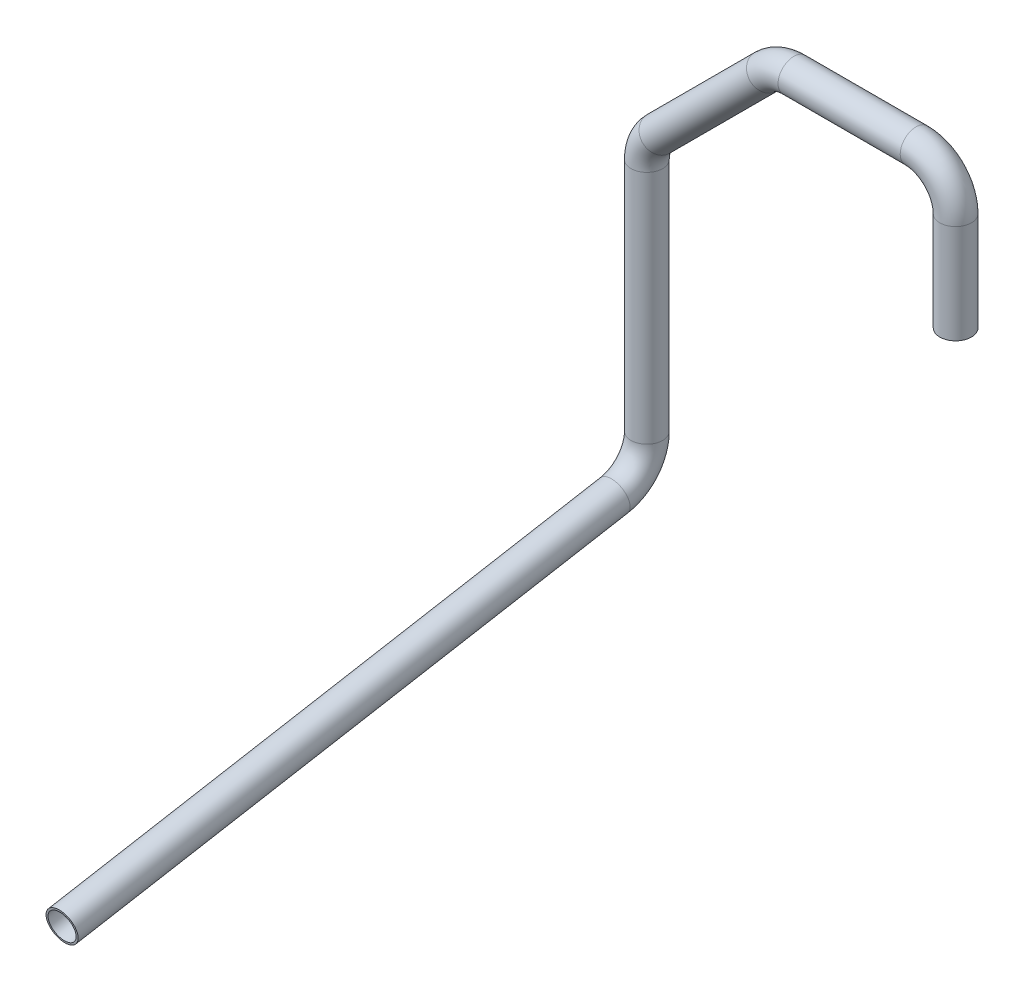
ISO-10303-21;
HEADER;
FILE_DESCRIPTION(('STEP AP214'),'2;1');
FILE_NAME('part.step','',(''),(''),'','','');
FILE_SCHEMA(('AUTOMOTIVE_DESIGN { 1 0 10303 214 1 1 1 1 }'));
ENDSEC;
DATA;
#1=APPLICATION_CONTEXT('core data for automotive mechanical design processes');
#2=APPLICATION_PROTOCOL_DEFINITION('international standard','automotive_design',2000,#1);
#3=PRODUCT_CONTEXT('',#1,'mechanical');
#4=PRODUCT('Part','Part','',(#3));
#5=PRODUCT_RELATED_PRODUCT_CATEGORY('part','',(#4));
#6=PRODUCT_DEFINITION_FORMATION('','',#4);
#7=PRODUCT_DEFINITION_CONTEXT('part definition',#1,'design');
#8=PRODUCT_DEFINITION('design','',#6,#7);
#9=PRODUCT_DEFINITION_SHAPE('','',#8);
#10=(LENGTH_UNIT() NAMED_UNIT(*) SI_UNIT(.MILLI.,.METRE.));
#11=(NAMED_UNIT(*) PLANE_ANGLE_UNIT() SI_UNIT($,.RADIAN.));
#12=(NAMED_UNIT(*) SI_UNIT($,.STERADIAN.) SOLID_ANGLE_UNIT());
#13=UNCERTAINTY_MEASURE_WITH_UNIT(LENGTH_MEASURE(1.E-05),#10,'distance_accuracy_value','');
#14=(GEOMETRIC_REPRESENTATION_CONTEXT(3) GLOBAL_UNCERTAINTY_ASSIGNED_CONTEXT((#13)) GLOBAL_UNIT_ASSIGNED_CONTEXT((#10,
#11,#12)) REPRESENTATION_CONTEXT('',''));
#15=CARTESIAN_POINT('',(0.,0.,0.));
#16=DIRECTION('',(0.,0.,1.));
#17=DIRECTION('',(1.,0.,0.));
#18=AXIS2_PLACEMENT_3D('',#15,#16,#17);
#19=CARTESIAN_POINT('',(0.,0.,0.));
#20=DIRECTION('',(0.,1.,0.));
#21=DIRECTION('',(0.,0.,-1.));
#22=AXIS2_PLACEMENT_3D('',#19,#20,#21);
#23=CYLINDRICAL_SURFACE('',#22,4.);
#24=CARTESIAN_POINT('',(0.,24.9999999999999,1.38777878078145E-13));
#25=DIRECTION('',(0.,-1.,0.));
#26=DIRECTION('',(0.,0.,-1.));
#27=AXIS2_PLACEMENT_3D('',#24,#25,#26);
#28=CIRCLE('',#27,4.);
#29=CARTESIAN_POINT('',(4.,24.9999999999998,1.38777878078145E-13));
#30=VERTEX_POINT('',#29);
#31=EDGE_CURVE('E97',#30,#30,#28,.T.);
#32=ORIENTED_EDGE('',*,*,#31,.T.);
#33=EDGE_LOOP('',(#32));
#34=FACE_BOUND('',#33,.T.);
#35=CARTESIAN_POINT('',(0.,0.,0.));
#36=DIRECTION('',(0.,-1.,0.));
#37=DIRECTION('',(0.,0.,-1.));
#38=AXIS2_PLACEMENT_3D('',#35,#36,#37);
#39=CIRCLE('',#38,4.);
#40=CARTESIAN_POINT('',(0.,0.,-4.00000000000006));
#41=VERTEX_POINT('',#40);
#42=EDGE_CURVE('E69',#41,#41,#39,.T.);
#43=ORIENTED_EDGE('',*,*,#42,.F.);
#44=EDGE_LOOP('',(#43));
#45=FACE_BOUND('',#44,.T.);
#46=ADVANCED_FACE('F54',(#34,#45),#23,.T.);
#47=CARTESIAN_POINT('',(-10.,24.9999999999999,1.38777878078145E-13));
#48=DIRECTION('',(0.,0.,-1.));
#49=DIRECTION('',(1.,0.,0.));
#50=AXIS2_PLACEMENT_3D('',#47,#48,#49);
#51=TOROIDAL_SURFACE('',#50,10.,4.);
#52=CARTESIAN_POINT('',(-10.0000000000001,34.9999999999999,0.));
#53=DIRECTION('',(1.,0.,0.));
#54=DIRECTION('',(0.,0.,-1.));
#55=AXIS2_PLACEMENT_3D('',#52,#53,#54);
#56=CIRCLE('',#55,4.);
#57=CARTESIAN_POINT('',(-10.0000000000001,38.9999999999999,-1.33226762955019E-13));
#58=VERTEX_POINT('',#57);
#59=EDGE_CURVE('E100',#58,#58,#56,.T.);
#60=CARTESIAN_POINT('',(-10.,24.9999999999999,1.38777878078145E-13));
#61=DIRECTION('',(0.,0.,-1.));
#62=DIRECTION('',(1.,0.,0.));
#63=AXIS2_PLACEMENT_3D('',#60,#61,#62);
#64=CIRCLE('',#63,14.);
#65=EDGE_CURVE('',#58,#30,#64,.T.);
#66=ORIENTED_EDGE('',*,*,#59,.T.);
#67=ORIENTED_EDGE('',*,*,#31,.F.);
#68=ORIENTED_EDGE('',*,*,#65,.T.);
#69=ORIENTED_EDGE('',*,*,#65,.F.);
#70=EDGE_LOOP('',(#66,#68,#67,#69));
#71=FACE_BOUND('',#70,.T.);
#72=ADVANCED_FACE('F135',(#71),#51,.T.);
#73=CARTESIAN_POINT('',(-10.0000000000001,34.9999999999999,0.));
#74=DIRECTION('',(-1.,0.,0.));
#75=DIRECTION('',(0.,0.,-1.));
#76=AXIS2_PLACEMENT_3D('',#73,#74,#75);
#77=CYLINDRICAL_SURFACE('',#76,4.);
#78=CARTESIAN_POINT('',(-40.857864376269,35.,0.));
#79=DIRECTION('',(1.,0.,0.));
#80=DIRECTION('',(0.,0.,-1.));
#81=AXIS2_PLACEMENT_3D('',#78,#79,#80);
#82=CIRCLE('',#81,4.);
#83=CARTESIAN_POINT('',(-40.857864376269,38.9999999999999,0.));
#84=VERTEX_POINT('',#83);
#85=EDGE_CURVE('E103',#84,#84,#82,.T.);
#86=ORIENTED_EDGE('',*,*,#85,.T.);
#87=EDGE_LOOP('',(#86));
#88=FACE_BOUND('',#87,.T.);
#89=ORIENTED_EDGE('',*,*,#59,.F.);
#90=EDGE_LOOP('',(#89));
#91=FACE_BOUND('',#90,.T.);
#92=ADVANCED_FACE('F141',(#88,#91),#77,.T.);
#93=CARTESIAN_POINT('',(-40.857864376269,24.9999999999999,0.));
#94=DIRECTION('',(0.,0.,-1.));
#95=DIRECTION('',(1.,0.,0.));
#96=AXIS2_PLACEMENT_3D('',#93,#94,#95);
#97=TOROIDAL_SURFACE('',#96,10.,4.);
#98=CARTESIAN_POINT('',(-47.9289321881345,32.0710678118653,0.));
#99=DIRECTION('',(0.707106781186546,0.70710678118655,0.));
#100=DIRECTION('',(0.,0.,-1.));
#101=AXIS2_PLACEMENT_3D('',#98,#99,#100);
#102=CIRCLE('',#101,4.);
#103=CARTESIAN_POINT('',(-50.7573593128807,34.8994949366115,0.));
#104=VERTEX_POINT('',#103);
#105=EDGE_CURVE('E106',#104,#104,#102,.T.);
#106=CARTESIAN_POINT('',(-40.857864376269,24.9999999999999,0.));
#107=DIRECTION('',(0.,0.,-1.));
#108=DIRECTION('',(1.,0.,0.));
#109=AXIS2_PLACEMENT_3D('',#106,#107,#108);
#110=CIRCLE('',#109,14.);
#111=EDGE_CURVE('',#104,#84,#110,.T.);
#112=ORIENTED_EDGE('',*,*,#105,.T.);
#113=ORIENTED_EDGE('',*,*,#85,.F.);
#114=ORIENTED_EDGE('',*,*,#111,.T.);
#115=ORIENTED_EDGE('',*,*,#111,.F.);
#116=EDGE_LOOP('',(#112,#114,#113,#115));
#117=FACE_BOUND('',#116,.T.);
#118=ADVANCED_FACE('F148',(#117),#97,.T.);
#119=CARTESIAN_POINT('',(-47.9289321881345,32.0710678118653,0.));
#120=DIRECTION('',(-0.707106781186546,-0.70710678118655,0.));
#121=DIRECTION('',(0.707106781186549,-0.707106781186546,0.));
#122=AXIS2_PLACEMENT_3D('',#119,#120,#121);
#123=CYLINDRICAL_SURFACE('',#122,4.);
#124=CARTESIAN_POINT('',(-75.0710678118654,4.92893218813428,1.11022302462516E-13));
#125=DIRECTION('',(0.707106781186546,0.707106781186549,0.));
#126=DIRECTION('',(0.,0.,-1.));
#127=AXIS2_PLACEMENT_3D('',#124,#125,#126);
#128=CIRCLE('',#127,4.);
#129=CARTESIAN_POINT('',(-77.8994949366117,7.75735931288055,1.66533453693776E-13));
#130=VERTEX_POINT('',#129);
#131=EDGE_CURVE('E109',#130,#130,#128,.T.);
#132=ORIENTED_EDGE('',*,*,#131,.T.);
#133=EDGE_LOOP('',(#132));
#134=FACE_BOUND('',#133,.T.);
#135=ORIENTED_EDGE('',*,*,#105,.F.);
#136=EDGE_LOOP('',(#135));
#137=FACE_BOUND('',#136,.T.);
#138=ADVANCED_FACE('F152',(#134,#137),#123,.T.);
#139=CARTESIAN_POINT('',(-68.,-2.14213562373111,0.));
#140=DIRECTION('',(0.,0.,-1.));
#141=DIRECTION('',(1.,0.,0.));
#142=AXIS2_PLACEMENT_3D('',#139,#140,#141);
#143=TOROIDAL_SURFACE('',#142,10.,4.);
#144=CARTESIAN_POINT('',(-78.,-2.14213562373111,1.38777878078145E-13));
#145=DIRECTION('',(0.,1.,0.));
#146=DIRECTION('',(0.,0.,-1.));
#147=AXIS2_PLACEMENT_3D('',#144,#145,#146);
#148=CIRCLE('',#147,4.);
#149=CARTESIAN_POINT('',(-82.,-2.14213562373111,2.05391259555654E-13));
#150=VERTEX_POINT('',#149);
#151=EDGE_CURVE('E112',#150,#150,#148,.T.);
#152=CARTESIAN_POINT('',(-68.,-2.14213562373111,0.));
#153=DIRECTION('',(0.,0.,-1.));
#154=DIRECTION('',(1.,0.,0.));
#155=AXIS2_PLACEMENT_3D('',#152,#153,#154);
#156=CIRCLE('',#155,14.);
#157=EDGE_CURVE('',#150,#130,#156,.T.);
#158=ORIENTED_EDGE('',*,*,#151,.T.);
#159=ORIENTED_EDGE('',*,*,#131,.F.);
#160=ORIENTED_EDGE('',*,*,#157,.T.);
#161=ORIENTED_EDGE('',*,*,#157,.F.);
#162=EDGE_LOOP('',(#158,#160,#159,#161));
#163=FACE_BOUND('',#162,.T.);
#164=ADVANCED_FACE('F156',(#163),#143,.T.);
#165=CARTESIAN_POINT('',(-78.,-2.14213562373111,1.38777878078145E-13));
#166=DIRECTION('',(0.,-1.,0.));
#167=DIRECTION('',(0.,0.,1.));
#168=AXIS2_PLACEMENT_3D('',#165,#166,#167);
#169=CYLINDRICAL_SURFACE('',#168,4.);
#170=CARTESIAN_POINT('',(-78.,-61.6090036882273,1.11022302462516E-13));
#171=DIRECTION('',(0.,1.,0.));
#172=DIRECTION('',(0.,0.,-1.));
#173=AXIS2_PLACEMENT_3D('',#170,#171,#172);
#174=CIRCLE('',#173,4.);
#175=CARTESIAN_POINT('',(-78.0000000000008,-61.6090036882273,-3.99999999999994));
#176=VERTEX_POINT('',#175);
#177=EDGE_CURVE('E114',#176,#176,#174,.T.);
#178=ORIENTED_EDGE('',*,*,#177,.T.);
#179=EDGE_LOOP('',(#178));
#180=FACE_BOUND('',#179,.T.);
#181=ORIENTED_EDGE('',*,*,#151,.F.);
#182=EDGE_LOOP('',(#181));
#183=FACE_BOUND('',#182,.T.);
#184=ADVANCED_FACE('F133',(#180,#183),#169,.T.);
#185=CARTESIAN_POINT('',(-77.9999999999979,-61.6090036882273,10.0000000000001));
#186=DIRECTION('',(1.,0.,-2.05555021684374E-13));
#187=DIRECTION('',(2.05227497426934E-13,0.,1.));
#188=AXIS2_PLACEMENT_3D('',#185,#186,#187);
#189=TOROIDAL_SURFACE('',#188,10.,4.);
#190=CARTESIAN_POINT('',(-77.9999999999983,-71.4570812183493,8.26351822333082));
#191=DIRECTION('',(-2.01987003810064E-13,0.173648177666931,-0.984807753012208));
#192=DIRECTION('',(1.69058427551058E-13,-0.984807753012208,-0.17364817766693));
#193=AXIS2_PLACEMENT_3D('',#190,#191,#192);
#194=CIRCLE('',#193,4.);
#195=CARTESIAN_POINT('',(-77.9999999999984,-75.3963122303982,7.5689255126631));
#196=VERTEX_POINT('',#195);
#197=EDGE_CURVE('E58',#196,#196,#194,.T.);
#198=CARTESIAN_POINT('',(-77.9999999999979,-61.6090036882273,10.0000000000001));
#199=DIRECTION('',(1.,0.,-2.05555021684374E-13));
#200=DIRECTION('',(2.05227497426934E-13,0.,1.));
#201=AXIS2_PLACEMENT_3D('',#198,#199,#200);
#202=CIRCLE('',#201,14.);
#203=EDGE_CURVE('',#196,#176,#202,.T.);
#204=ORIENTED_EDGE('',*,*,#197,.T.);
#205=ORIENTED_EDGE('',*,*,#177,.F.);
#206=ORIENTED_EDGE('',*,*,#203,.T.);
#207=ORIENTED_EDGE('',*,*,#203,.F.);
#208=EDGE_LOOP('',(#204,#206,#205,#207));
#209=FACE_BOUND('',#208,.T.);
#210=ADVANCED_FACE('F123',(#209),#189,.T.);
#211=CARTESIAN_POINT('',(-77.9999999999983,-71.4570812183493,8.26351822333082));
#212=DIRECTION('',(2.0220812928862E-13,-0.173648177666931,0.984807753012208));
#213=DIRECTION('',(0.,0.984807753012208,0.17364817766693));
#214=AXIS2_PLACEMENT_3D('',#211,#212,#213);
#215=CYLINDRICAL_SURFACE('',#214,4.);
#216=CARTESIAN_POINT('',(-77.9999999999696,-96.0472266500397,147.721162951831));
#217=DIRECTION('',(-2.0220812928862E-13,0.173648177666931,-0.984807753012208));
#218=DIRECTION('',(1.69058427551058E-13,-0.984807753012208,-0.17364817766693));
#219=AXIS2_PLACEMENT_3D('',#216,#217,#218);
#220=CIRCLE('',#219,4.);
#221=CARTESIAN_POINT('',(-77.9999999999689,-99.9864576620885,147.026570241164));
#222=VERTEX_POINT('',#221);
#223=EDGE_CURVE('E74',#222,#222,#220,.T.);
#224=ORIENTED_EDGE('',*,*,#223,.T.);
#225=EDGE_LOOP('',(#224));
#226=FACE_BOUND('',#225,.T.);
#227=ORIENTED_EDGE('',*,*,#197,.F.);
#228=EDGE_LOOP('',(#227));
#229=FACE_BOUND('',#228,.T.);
#230=ADVANCED_FACE('F56',(#226,#229),#215,.T.);
#231=CARTESIAN_POINT('',(0.,0.,0.));
#232=DIRECTION('',(0.,1.,0.));
#233=DIRECTION('',(0.,0.,-1.));
#234=AXIS2_PLACEMENT_3D('',#231,#232,#233);
#235=PLANE('',#234);
#236=CARTESIAN_POINT('',(0.,0.,0.));
#237=DIRECTION('',(0.,-1.,0.));
#238=DIRECTION('',(0.,0.,-1.));
#239=AXIS2_PLACEMENT_3D('',#236,#237,#238);
#240=CIRCLE('',#239,3.5);
#241=CARTESIAN_POINT('',(0.,0.,-3.49999999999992));
#242=VERTEX_POINT('',#241);
#243=EDGE_CURVE('E90',#242,#242,#240,.F.);
#244=ORIENTED_EDGE('',*,*,#243,.T.);
#245=EDGE_LOOP('',(#244));
#246=FACE_BOUND('',#245,.T.);
#247=ORIENTED_EDGE('',*,*,#42,.T.);
#248=EDGE_LOOP('',(#247));
#249=FACE_BOUND('',#248,.T.);
#250=ADVANCED_FACE('F88',(#246,#249),#235,.F.);
#251=CARTESIAN_POINT('',(-77.9999999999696,-96.0472266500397,147.721162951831));
#252=DIRECTION('',(2.0220812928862E-13,-0.173648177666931,0.984807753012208));
#253=DIRECTION('',(1.69058427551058E-13,-0.984807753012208,-0.17364817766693));
#254=AXIS2_PLACEMENT_3D('',#251,#252,#253);
#255=PLANE('',#254);
#256=CARTESIAN_POINT('',(-77.9999999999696,-96.0472266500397,147.721162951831));
#257=DIRECTION('',(-2.0220812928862E-13,0.173648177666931,-0.984807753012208));
#258=DIRECTION('',(1.69058427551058E-13,-0.984807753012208,-0.17364817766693));
#259=AXIS2_PLACEMENT_3D('',#256,#257,#258);
#260=CIRCLE('',#259,3.5);
#261=CARTESIAN_POINT('',(-77.9999999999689,-99.4940537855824,147.113394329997));
#262=VERTEX_POINT('',#261);
#263=EDGE_CURVE('E13',#262,#262,#260,.F.);
#264=ORIENTED_EDGE('',*,*,#263,.F.);
#265=EDGE_LOOP('',(#264));
#266=FACE_BOUND('',#265,.T.);
#267=ORIENTED_EDGE('',*,*,#223,.F.);
#268=EDGE_LOOP('',(#267));
#269=FACE_BOUND('',#268,.T.);
#270=ADVANCED_FACE('F84',(#266,#269),#255,.T.);
#271=CARTESIAN_POINT('',(0.,0.,0.));
#272=DIRECTION('',(0.,1.,0.));
#273=DIRECTION('',(0.,0.,-1.));
#274=AXIS2_PLACEMENT_3D('',#271,#272,#273);
#275=CYLINDRICAL_SURFACE('',#274,3.5);
#276=CARTESIAN_POINT('',(0.,24.9999999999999,1.38777878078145E-13));
#277=DIRECTION('',(0.,-1.,0.));
#278=DIRECTION('',(0.,0.,-1.));
#279=AXIS2_PLACEMENT_3D('',#276,#277,#278);
#280=CIRCLE('',#279,3.5);
#281=CARTESIAN_POINT('',(3.5,24.9999999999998,1.38777878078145E-13));
#282=VERTEX_POINT('',#281);
#283=EDGE_CURVE('E92',#282,#282,#280,.F.);
#284=ORIENTED_EDGE('',*,*,#283,.T.);
#285=EDGE_LOOP('',(#284));
#286=FACE_BOUND('',#285,.T.);
#287=ORIENTED_EDGE('',*,*,#243,.F.);
#288=EDGE_LOOP('',(#287));
#289=FACE_BOUND('',#288,.T.);
#290=ADVANCED_FACE('F87',(#286,#289),#275,.F.);
#291=CARTESIAN_POINT('',(-10.,24.9999999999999,1.38777878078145E-13));
#292=DIRECTION('',(0.,0.,-1.));
#293=DIRECTION('',(1.,0.,0.));
#294=AXIS2_PLACEMENT_3D('',#291,#292,#293);
#295=TOROIDAL_SURFACE('',#294,10.,3.5);
#296=CARTESIAN_POINT('',(-10.0000000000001,34.9999999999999,0.));
#297=DIRECTION('',(1.,0.,0.));
#298=DIRECTION('',(0.,0.,-1.));
#299=AXIS2_PLACEMENT_3D('',#296,#297,#298);
#300=CIRCLE('',#299,3.5);
#301=CARTESIAN_POINT('',(-10.0000000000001,38.4999999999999,-1.23512311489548E-13));
#302=VERTEX_POINT('',#301);
#303=EDGE_CURVE('E289',#302,#302,#300,.F.);
#304=CARTESIAN_POINT('',(-10.,24.9999999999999,1.38777878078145E-13));
#305=DIRECTION('',(0.,0.,-1.));
#306=DIRECTION('',(1.,0.,0.));
#307=AXIS2_PLACEMENT_3D('',#304,#305,#306);
#308=CIRCLE('',#307,13.5);
#309=EDGE_CURVE('',#302,#282,#308,.T.);
#310=ORIENTED_EDGE('',*,*,#303,.T.);
#311=ORIENTED_EDGE('',*,*,#283,.F.);
#312=ORIENTED_EDGE('',*,*,#309,.T.);
#313=ORIENTED_EDGE('',*,*,#309,.F.);
#314=EDGE_LOOP('',(#310,#312,#311,#313));
#315=FACE_BOUND('',#314,.T.);
#316=ADVANCED_FACE('F266',(#315),#295,.F.);
#317=CARTESIAN_POINT('',(-10.0000000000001,34.9999999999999,0.));
#318=DIRECTION('',(-1.,0.,0.));
#319=DIRECTION('',(0.,0.,-1.));
#320=AXIS2_PLACEMENT_3D('',#317,#318,#319);
#321=CYLINDRICAL_SURFACE('',#320,3.5);
#322=CARTESIAN_POINT('',(-40.857864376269,35.,0.));
#323=DIRECTION('',(1.,0.,0.));
#324=DIRECTION('',(0.,0.,-1.));
#325=AXIS2_PLACEMENT_3D('',#322,#323,#324);
#326=CIRCLE('',#325,3.5);
#327=CARTESIAN_POINT('',(-40.857864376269,38.4999999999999,0.));
#328=VERTEX_POINT('',#327);
#329=EDGE_CURVE('E292',#328,#328,#326,.F.);
#330=ORIENTED_EDGE('',*,*,#329,.T.);
#331=EDGE_LOOP('',(#330));
#332=FACE_BOUND('',#331,.T.);
#333=ORIENTED_EDGE('',*,*,#303,.F.);
#334=EDGE_LOOP('',(#333));
#335=FACE_BOUND('',#334,.T.);
#336=ADVANCED_FACE('F258',(#332,#335),#321,.F.);
#337=CARTESIAN_POINT('',(-40.857864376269,24.9999999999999,0.));
#338=DIRECTION('',(0.,0.,-1.));
#339=DIRECTION('',(1.,0.,0.));
#340=AXIS2_PLACEMENT_3D('',#337,#338,#339);
#341=TOROIDAL_SURFACE('',#340,10.,3.5);
#342=CARTESIAN_POINT('',(-47.9289321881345,32.0710678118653,0.));
#343=DIRECTION('',(0.707106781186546,0.70710678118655,0.));
#344=DIRECTION('',(0.,0.,-1.));
#345=AXIS2_PLACEMENT_3D('',#342,#343,#344);
#346=CIRCLE('',#345,3.5);
#347=CARTESIAN_POINT('',(-50.4038059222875,34.5459415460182,0.));
#348=VERTEX_POINT('',#347);
#349=EDGE_CURVE('E297',#348,#348,#346,.F.);
#350=CARTESIAN_POINT('',(-40.857864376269,24.9999999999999,0.));
#351=DIRECTION('',(0.,0.,-1.));
#352=DIRECTION('',(1.,0.,0.));
#353=AXIS2_PLACEMENT_3D('',#350,#351,#352);
#354=CIRCLE('',#353,13.5);
#355=EDGE_CURVE('',#348,#328,#354,.T.);
#356=ORIENTED_EDGE('',*,*,#349,.T.);
#357=ORIENTED_EDGE('',*,*,#329,.F.);
#358=ORIENTED_EDGE('',*,*,#355,.T.);
#359=ORIENTED_EDGE('',*,*,#355,.F.);
#360=EDGE_LOOP('',(#356,#358,#357,#359));
#361=FACE_BOUND('',#360,.T.);
#362=ADVANCED_FACE('F250',(#361),#341,.F.);
#363=CARTESIAN_POINT('',(-47.9289321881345,32.0710678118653,0.));
#364=DIRECTION('',(-0.707106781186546,-0.70710678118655,0.));
#365=DIRECTION('',(0.707106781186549,-0.707106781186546,0.));
#366=AXIS2_PLACEMENT_3D('',#363,#364,#365);
#367=CYLINDRICAL_SURFACE('',#366,3.5);
#368=CARTESIAN_POINT('',(-75.0710678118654,4.92893218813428,1.11022302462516E-13));
#369=DIRECTION('',(0.707106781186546,0.707106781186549,0.));
#370=DIRECTION('',(0.,0.,-1.));
#371=AXIS2_PLACEMENT_3D('',#368,#369,#370);
#372=CIRCLE('',#371,3.5);
#373=CARTESIAN_POINT('',(-77.5459415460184,7.40380592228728,1.59594559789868E-13));
#374=VERTEX_POINT('',#373);
#375=EDGE_CURVE('E300',#374,#374,#372,.F.);
#376=ORIENTED_EDGE('',*,*,#375,.T.);
#377=EDGE_LOOP('',(#376));
#378=FACE_BOUND('',#377,.T.);
#379=ORIENTED_EDGE('',*,*,#349,.F.);
#380=EDGE_LOOP('',(#379));
#381=FACE_BOUND('',#380,.T.);
#382=ADVANCED_FACE('F242',(#378,#381),#367,.F.);
#383=CARTESIAN_POINT('',(-68.,-2.14213562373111,0.));
#384=DIRECTION('',(0.,0.,-1.));
#385=DIRECTION('',(1.,0.,0.));
#386=AXIS2_PLACEMENT_3D('',#383,#384,#385);
#387=TOROIDAL_SURFACE('',#386,10.,3.5);
#388=CARTESIAN_POINT('',(-78.,-2.14213562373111,1.38777878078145E-13));
#389=DIRECTION('',(0.,1.,0.));
#390=DIRECTION('',(0.,0.,-1.));
#391=AXIS2_PLACEMENT_3D('',#388,#389,#390);
#392=CIRCLE('',#391,3.5);
#393=CARTESIAN_POINT('',(-81.5,-2.14213562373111,1.97064586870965E-13));
#394=VERTEX_POINT('',#393);
#395=EDGE_CURVE('E303',#394,#394,#392,.F.);
#396=CARTESIAN_POINT('',(-68.,-2.14213562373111,0.));
#397=DIRECTION('',(0.,0.,-1.));
#398=DIRECTION('',(1.,0.,0.));
#399=AXIS2_PLACEMENT_3D('',#396,#397,#398);
#400=CIRCLE('',#399,13.5);
#401=EDGE_CURVE('',#394,#374,#400,.T.);
#402=ORIENTED_EDGE('',*,*,#395,.T.);
#403=ORIENTED_EDGE('',*,*,#375,.F.);
#404=ORIENTED_EDGE('',*,*,#401,.T.);
#405=ORIENTED_EDGE('',*,*,#401,.F.);
#406=EDGE_LOOP('',(#402,#404,#403,#405));
#407=FACE_BOUND('',#406,.T.);
#408=ADVANCED_FACE('F235',(#407),#387,.F.);
#409=CARTESIAN_POINT('',(-78.,-2.14213562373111,1.38777878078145E-13));
#410=DIRECTION('',(0.,-1.,0.));
#411=DIRECTION('',(0.,0.,1.));
#412=AXIS2_PLACEMENT_3D('',#409,#410,#411);
#413=CYLINDRICAL_SURFACE('',#412,3.5);
#414=CARTESIAN_POINT('',(-78.,-61.6090036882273,1.11022302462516E-13));
#415=DIRECTION('',(0.,1.,0.));
#416=DIRECTION('',(0.,0.,-1.));
#417=AXIS2_PLACEMENT_3D('',#414,#415,#416);
#418=CIRCLE('',#417,3.5);
#419=CARTESIAN_POINT('',(-78.0000000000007,-61.6090036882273,-3.49999999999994));
#420=VERTEX_POINT('',#419);
#421=EDGE_CURVE('E306',#420,#420,#418,.F.);
#422=ORIENTED_EDGE('',*,*,#421,.T.);
#423=EDGE_LOOP('',(#422));
#424=FACE_BOUND('',#423,.T.);
#425=ORIENTED_EDGE('',*,*,#395,.F.);
#426=EDGE_LOOP('',(#425));
#427=FACE_BOUND('',#426,.T.);
#428=ADVANCED_FACE('F227',(#424,#427),#413,.F.);
#429=CARTESIAN_POINT('',(-77.9999999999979,-61.6090036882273,10.0000000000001));
#430=DIRECTION('',(1.,0.,-2.05555021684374E-13));
#431=DIRECTION('',(2.05227497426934E-13,0.,1.));
#432=AXIS2_PLACEMENT_3D('',#429,#430,#431);
#433=TOROIDAL_SURFACE('',#432,10.,3.5);
#434=CARTESIAN_POINT('',(-77.9999999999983,-71.4570812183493,8.26351822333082));
#435=DIRECTION('',(-2.01987003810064E-13,0.173648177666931,-0.984807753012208));
#436=DIRECTION('',(1.69058427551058E-13,-0.984807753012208,-0.17364817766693));
#437=AXIS2_PLACEMENT_3D('',#434,#435,#436);
#438=CIRCLE('',#437,3.5);
#439=CARTESIAN_POINT('',(-77.9999999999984,-74.9039083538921,7.65574960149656));
#440=VERTEX_POINT('',#439);
#441=EDGE_CURVE('E63',#440,#440,#438,.F.);
#442=CARTESIAN_POINT('',(-77.9999999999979,-61.6090036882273,10.0000000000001));
#443=DIRECTION('',(1.,0.,-2.05555021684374E-13));
#444=DIRECTION('',(2.05227497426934E-13,0.,1.));
#445=AXIS2_PLACEMENT_3D('',#442,#443,#444);
#446=CIRCLE('',#445,13.5);
#447=EDGE_CURVE('',#440,#420,#446,.T.);
#448=ORIENTED_EDGE('',*,*,#441,.T.);
#449=ORIENTED_EDGE('',*,*,#421,.F.);
#450=ORIENTED_EDGE('',*,*,#447,.T.);
#451=ORIENTED_EDGE('',*,*,#447,.F.);
#452=EDGE_LOOP('',(#448,#450,#449,#451));
#453=FACE_BOUND('',#452,.T.);
#454=ADVANCED_FACE('F222',(#453),#433,.F.);
#455=CARTESIAN_POINT('',(-77.9999999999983,-71.4570812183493,8.26351822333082));
#456=DIRECTION('',(2.0220812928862E-13,-0.173648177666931,0.984807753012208));
#457=DIRECTION('',(0.,0.984807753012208,0.17364817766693));
#458=AXIS2_PLACEMENT_3D('',#455,#456,#457);
#459=CYLINDRICAL_SURFACE('',#458,3.5);
#460=ORIENTED_EDGE('',*,*,#263,.T.);
#461=EDGE_LOOP('',(#460));
#462=FACE_BOUND('',#461,.T.);
#463=ORIENTED_EDGE('',*,*,#441,.F.);
#464=EDGE_LOOP('',(#463));
#465=FACE_BOUND('',#464,.T.);
#466=ADVANCED_FACE('F81',(#462,#465),#459,.F.);
#467=CLOSED_SHELL('',(#46,#72,#92,#118,#138,#164,#184,#210,#230,#250,#270,#290,#316,#336,#362,
#382,#408,#428,#454,#466));
#468=MANIFOLD_SOLID_BREP('B2',#467);
#469=ADVANCED_BREP_SHAPE_REPRESENTATION('',(#18,#468),#14);
#470=SHAPE_DEFINITION_REPRESENTATION(#9,#469);
ENDSEC;
END-ISO-10303-21;
